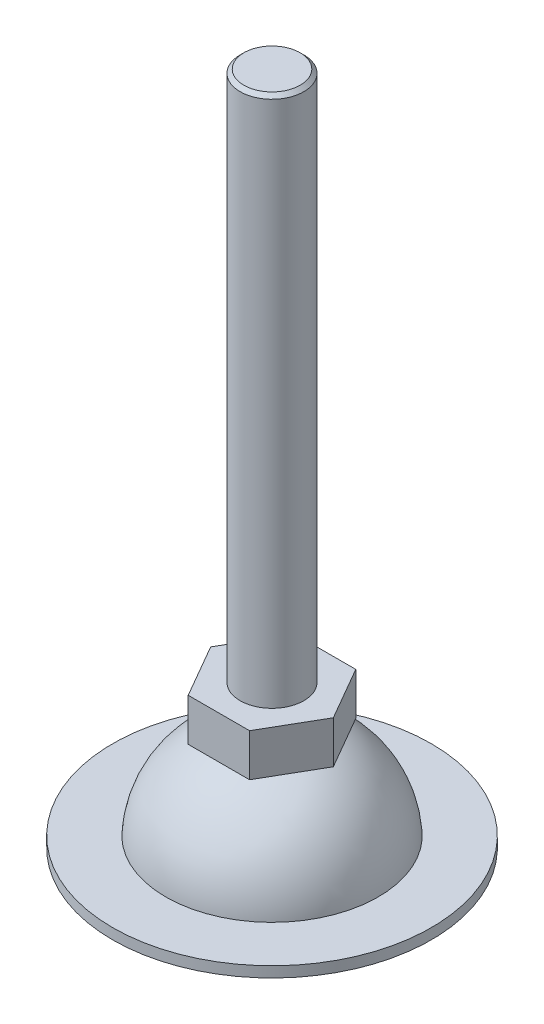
from build123d import *

# Parameters (mm, degrees)
EXTRUDE_1_DEPTH = 8


with BuildPart() as part:
    # Sketch 1 → Revolve 1 (revolve)
    with BuildSketch(Plane(origin=(0, 0, 0), x_dir=(0, 0, -1), z_dir=(1, 0, 0))):
        with BuildLine():
            Line((0, 127), (0, 0))
            Line((0, 0), (-30, 0))
            Line((-30, 0), (-30, 2))
            Line((-30, 2), (-20, 2))
            ThreePointArc((-20, 2), (-15.793312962, 12.935960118), (-6, 19.368880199))
            Line((-6, 19.368880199), (-6, 126.3))
            Line((-6, 126.3), (-5.3, 127))
            Line((-5.3, 127), (0, 127))
        make_face()
    revolve(axis=Axis((0, 127, 0), (0, -1, 0)))

    # Sketch 2 → Extrude 1 (add)
    with BuildSketch(Plane.XZ.offset(-19)):
        Polygon((-11.547005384, 0), (-5.773502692, 10), (5.773502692, 10), (11.547005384, 0), (5.773502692, -10), (-5.773502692, -10), align=None)
    extrude(amount=-EXTRUDE_1_DEPTH)


solid = part.part
